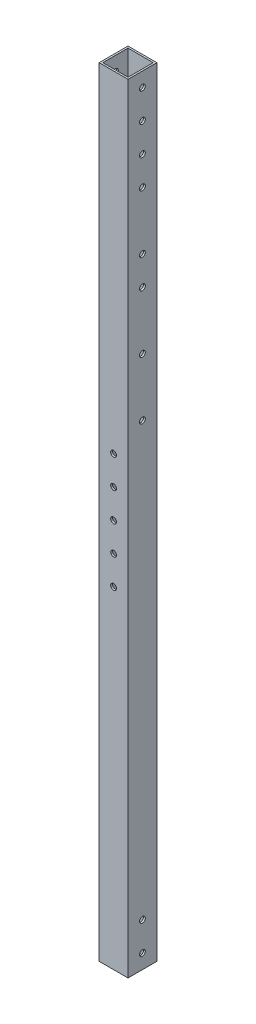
ISO-10303-21;
HEADER;
FILE_DESCRIPTION(('STEP AP214'),'2;1');
FILE_NAME('part.step','',(''),(''),'','','');
FILE_SCHEMA(('AUTOMOTIVE_DESIGN { 1 0 10303 214 1 1 1 1 }'));
ENDSEC;
DATA;
#1=APPLICATION_CONTEXT('core data for automotive mechanical design processes');
#2=APPLICATION_PROTOCOL_DEFINITION('international standard','automotive_design',2000,#1);
#3=PRODUCT_CONTEXT('',#1,'mechanical');
#4=PRODUCT('Part','Part','',(#3));
#5=PRODUCT_RELATED_PRODUCT_CATEGORY('part','',(#4));
#6=PRODUCT_DEFINITION_FORMATION('','',#4);
#7=PRODUCT_DEFINITION_CONTEXT('part definition',#1,'design');
#8=PRODUCT_DEFINITION('design','',#6,#7);
#9=PRODUCT_DEFINITION_SHAPE('','',#8);
#10=(LENGTH_UNIT() NAMED_UNIT(*) SI_UNIT(.MILLI.,.METRE.));
#11=(NAMED_UNIT(*) PLANE_ANGLE_UNIT() SI_UNIT($,.RADIAN.));
#12=(NAMED_UNIT(*) SI_UNIT($,.STERADIAN.) SOLID_ANGLE_UNIT());
#13=UNCERTAINTY_MEASURE_WITH_UNIT(LENGTH_MEASURE(1.E-05),#10,'distance_accuracy_value','');
#14=(GEOMETRIC_REPRESENTATION_CONTEXT(3) GLOBAL_UNCERTAINTY_ASSIGNED_CONTEXT((#13)) GLOBAL_UNIT_ASSIGNED_CONTEXT((#10,
#11,#12)) REPRESENTATION_CONTEXT('',''));
#15=CARTESIAN_POINT('',(0.,0.,0.));
#16=DIRECTION('',(0.,0.,1.));
#17=DIRECTION('',(1.,0.,0.));
#18=AXIS2_PLACEMENT_3D('',#15,#16,#17);
#19=CARTESIAN_POINT('',(0.,685.8,0.));
#20=DIRECTION('',(0.,-1.,0.));
#21=DIRECTION('',(0.,0.,-1.));
#22=AXIS2_PLACEMENT_3D('',#19,#20,#21);
#23=PLANE('',#22);
#24=DIRECTION('',(0.,0.,-1.));
#25=VECTOR('',#24,1.);
#26=CARTESIAN_POINT('',(12.7,685.8,12.7));
#27=LINE('',#26,#25);
#28=CARTESIAN_POINT('',(12.7,685.8,12.7));
#29=VERTEX_POINT('',#28);
#30=CARTESIAN_POINT('',(12.7,685.8,-12.7));
#31=VERTEX_POINT('',#30);
#32=EDGE_CURVE('E137',#29,#31,#27,.T.);
#33=ORIENTED_EDGE('',*,*,#32,.T.);
#34=DIRECTION('',(-1.,0.,0.));
#35=VECTOR('',#34,1.);
#36=CARTESIAN_POINT('',(-12.7,685.8,-12.7));
#37=LINE('',#36,#35);
#38=CARTESIAN_POINT('',(-12.7,685.8,-12.7));
#39=VERTEX_POINT('',#38);
#40=EDGE_CURVE('E140',#31,#39,#37,.T.);
#41=ORIENTED_EDGE('',*,*,#40,.T.);
#42=DIRECTION('',(0.,0.,1.));
#43=VECTOR('',#42,1.);
#44=CARTESIAN_POINT('',(-12.7,685.8,12.7));
#45=LINE('',#44,#43);
#46=CARTESIAN_POINT('',(-12.7,685.8,12.7));
#47=VERTEX_POINT('',#46);
#48=EDGE_CURVE('E143',#39,#47,#45,.T.);
#49=ORIENTED_EDGE('',*,*,#48,.T.);
#50=DIRECTION('',(1.,0.,0.));
#51=VECTOR('',#50,1.);
#52=CARTESIAN_POINT('',(-12.7,685.8,12.7));
#53=LINE('',#52,#51);
#54=EDGE_CURVE('E145',#47,#29,#53,.T.);
#55=ORIENTED_EDGE('',*,*,#54,.T.);
#56=EDGE_LOOP('',(#33,#41,#49,#55));
#57=FACE_BOUND('',#56,.T.);
#58=DIRECTION('',(0.,0.,-1.));
#59=VECTOR('',#58,1.);
#60=CARTESIAN_POINT('',(11.1125,685.8,11.1125));
#61=LINE('',#60,#59);
#62=CARTESIAN_POINT('',(11.1125,685.8,11.1125));
#63=VERTEX_POINT('',#62);
#64=CARTESIAN_POINT('',(11.1125,685.8,-11.1125));
#65=VERTEX_POINT('',#64);
#66=EDGE_CURVE('E99',#63,#65,#61,.T.);
#67=ORIENTED_EDGE('',*,*,#66,.F.);
#68=DIRECTION('',(1.,0.,0.));
#69=VECTOR('',#68,1.);
#70=CARTESIAN_POINT('',(-11.1125,685.8,11.1125));
#71=LINE('',#70,#69);
#72=CARTESIAN_POINT('',(-11.1125,685.8,11.1125));
#73=VERTEX_POINT('',#72);
#74=EDGE_CURVE('E121',#73,#63,#71,.T.);
#75=ORIENTED_EDGE('',*,*,#74,.F.);
#76=DIRECTION('',(0.,0.,1.));
#77=VECTOR('',#76,1.);
#78=CARTESIAN_POINT('',(-11.1125,685.8,11.1125));
#79=LINE('',#78,#77);
#80=CARTESIAN_POINT('',(-11.1125,685.8,-11.1125));
#81=VERTEX_POINT('',#80);
#82=EDGE_CURVE('E119',#81,#73,#79,.T.);
#83=ORIENTED_EDGE('',*,*,#82,.F.);
#84=DIRECTION('',(-1.,0.,0.));
#85=VECTOR('',#84,1.);
#86=CARTESIAN_POINT('',(-11.1125,685.8,-11.1125));
#87=LINE('',#86,#85);
#88=EDGE_CURVE('E107',#65,#81,#87,.T.);
#89=ORIENTED_EDGE('',*,*,#88,.F.);
#90=EDGE_LOOP('',(#67,#75,#83,#89));
#91=FACE_BOUND('',#90,.T.);
#92=ADVANCED_FACE('F32',(#57,#91),#23,.F.);
#93=CARTESIAN_POINT('',(0.,0.,0.));
#94=DIRECTION('',(0.,-1.,0.));
#95=DIRECTION('',(0.,0.,-1.));
#96=AXIS2_PLACEMENT_3D('',#93,#94,#95);
#97=PLANE('',#96);
#98=DIRECTION('',(0.,0.,-1.));
#99=VECTOR('',#98,1.);
#100=CARTESIAN_POINT('',(12.7,0.,12.7));
#101=LINE('',#100,#99);
#102=CARTESIAN_POINT('',(12.7,0.,12.7));
#103=VERTEX_POINT('',#102);
#104=CARTESIAN_POINT('',(12.7,0.,-12.7));
#105=VERTEX_POINT('',#104);
#106=EDGE_CURVE('E115',#103,#105,#101,.T.);
#107=ORIENTED_EDGE('',*,*,#106,.F.);
#108=DIRECTION('',(1.,0.,0.));
#109=VECTOR('',#108,1.);
#110=CARTESIAN_POINT('',(-12.7,0.,12.7));
#111=LINE('',#110,#109);
#112=CARTESIAN_POINT('',(-12.7,0.,12.7));
#113=VERTEX_POINT('',#112);
#114=EDGE_CURVE('E141',#113,#103,#111,.T.);
#115=ORIENTED_EDGE('',*,*,#114,.F.);
#116=DIRECTION('',(0.,0.,1.));
#117=VECTOR('',#116,1.);
#118=CARTESIAN_POINT('',(-12.7,0.,12.7));
#119=LINE('',#118,#117);
#120=CARTESIAN_POINT('',(-12.7,0.,-12.7));
#121=VERTEX_POINT('',#120);
#122=EDGE_CURVE('E152',#121,#113,#119,.T.);
#123=ORIENTED_EDGE('',*,*,#122,.F.);
#124=DIRECTION('',(-1.,0.,0.));
#125=VECTOR('',#124,1.);
#126=CARTESIAN_POINT('',(-12.7,0.,-12.7));
#127=LINE('',#126,#125);
#128=EDGE_CURVE('E150',#105,#121,#127,.T.);
#129=ORIENTED_EDGE('',*,*,#128,.F.);
#130=EDGE_LOOP('',(#107,#115,#123,#129));
#131=FACE_BOUND('',#130,.T.);
#132=DIRECTION('',(1.,0.,0.));
#133=VECTOR('',#132,1.);
#134=CARTESIAN_POINT('',(-11.1125,0.,11.1125));
#135=LINE('',#134,#133);
#136=CARTESIAN_POINT('',(-11.1125,0.,11.1125));
#137=VERTEX_POINT('',#136);
#138=CARTESIAN_POINT('',(11.1125,0.,11.1125));
#139=VERTEX_POINT('',#138);
#140=EDGE_CURVE('E108',#137,#139,#135,.T.);
#141=ORIENTED_EDGE('',*,*,#140,.T.);
#142=DIRECTION('',(0.,0.,-1.));
#143=VECTOR('',#142,1.);
#144=CARTESIAN_POINT('',(11.1125,0.,11.1125));
#145=LINE('',#144,#143);
#146=CARTESIAN_POINT('',(11.1125,0.,-11.1125));
#147=VERTEX_POINT('',#146);
#148=EDGE_CURVE('E57',#139,#147,#145,.T.);
#149=ORIENTED_EDGE('',*,*,#148,.T.);
#150=DIRECTION('',(-1.,0.,0.));
#151=VECTOR('',#150,1.);
#152=CARTESIAN_POINT('',(-11.1125,0.,-11.1125));
#153=LINE('',#152,#151);
#154=CARTESIAN_POINT('',(-11.1125,0.,-11.1125));
#155=VERTEX_POINT('',#154);
#156=EDGE_CURVE('E114',#147,#155,#153,.T.);
#157=ORIENTED_EDGE('',*,*,#156,.T.);
#158=DIRECTION('',(0.,0.,1.));
#159=VECTOR('',#158,1.);
#160=CARTESIAN_POINT('',(-11.1125,0.,11.1125));
#161=LINE('',#160,#159);
#162=EDGE_CURVE('E129',#155,#137,#161,.T.);
#163=ORIENTED_EDGE('',*,*,#162,.T.);
#164=EDGE_LOOP('',(#141,#149,#157,#163));
#165=FACE_BOUND('',#164,.T.);
#166=ADVANCED_FACE('F354',(#131,#165),#97,.T.);
#167=CARTESIAN_POINT('',(12.7,685.8,12.7));
#168=DIRECTION('',(-1.,0.,0.));
#169=DIRECTION('',(0.,0.,1.));
#170=AXIS2_PLACEMENT_3D('',#167,#168,#169);
#171=PLANE('',#170);
#172=CARTESIAN_POINT('',(12.7,12.7,0.));
#173=DIRECTION('',(1.,0.,0.));
#174=DIRECTION('',(0.,0.,-1.));
#175=AXIS2_PLACEMENT_3D('',#172,#173,#174);
#176=CIRCLE('',#175,2.55269999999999);
#177=CARTESIAN_POINT('',(12.7,12.7,-2.55269999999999));
#178=VERTEX_POINT('',#177);
#179=EDGE_CURVE('E493',#178,#178,#176,.T.);
#180=ORIENTED_EDGE('',*,*,#179,.F.);
#181=EDGE_LOOP('',(#180));
#182=FACE_BOUND('',#181,.T.);
#183=CARTESIAN_POINT('',(12.7,38.1,0.));
#184=DIRECTION('',(1.,0.,0.));
#185=DIRECTION('',(0.,0.,-1.));
#186=AXIS2_PLACEMENT_3D('',#183,#184,#185);
#187=CIRCLE('',#186,2.55269999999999);
#188=CARTESIAN_POINT('',(12.7,38.1,-2.5526999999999));
#189=VERTEX_POINT('',#188);
#190=EDGE_CURVE('E201',#189,#189,#187,.T.);
#191=ORIENTED_EDGE('',*,*,#190,.F.);
#192=EDGE_LOOP('',(#191));
#193=FACE_BOUND('',#192,.T.);
#194=CARTESIAN_POINT('',(12.7,622.3,2.09107978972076E-12));
#195=DIRECTION('',(1.,0.,0.));
#196=DIRECTION('',(0.,0.,-1.));
#197=AXIS2_PLACEMENT_3D('',#194,#195,#196);
#198=CIRCLE('',#197,2.55269999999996);
#199=CARTESIAN_POINT('',(12.7,622.3,-2.55269999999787));
#200=VERTEX_POINT('',#199);
#201=EDGE_CURVE('E198',#200,#200,#198,.T.);
#202=ORIENTED_EDGE('',*,*,#201,.F.);
#203=EDGE_LOOP('',(#202));
#204=FACE_BOUND('',#203,.T.);
#205=CARTESIAN_POINT('',(12.7,647.7,2.17820811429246E-12));
#206=DIRECTION('',(1.,0.,0.));
#207=DIRECTION('',(0.,0.,-1.));
#208=AXIS2_PLACEMENT_3D('',#205,#206,#207);
#209=CIRCLE('',#208,2.55269999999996);
#210=CARTESIAN_POINT('',(12.7,647.7,-2.55269999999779));
#211=VERTEX_POINT('',#210);
#212=EDGE_CURVE('E221',#211,#211,#209,.T.);
#213=ORIENTED_EDGE('',*,*,#212,.F.);
#214=EDGE_LOOP('',(#213));
#215=FACE_BOUND('',#214,.T.);
#216=CARTESIAN_POINT('',(12.7,673.1,2.26533643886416E-12));
#217=DIRECTION('',(1.,0.,0.));
#218=DIRECTION('',(0.,0.,-1.));
#219=AXIS2_PLACEMENT_3D('',#216,#217,#218);
#220=CIRCLE('',#219,2.55269999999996);
#221=CARTESIAN_POINT('',(12.7,673.1,-2.5526999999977));
#222=VERTEX_POINT('',#221);
#223=EDGE_CURVE('E228',#222,#222,#220,.T.);
#224=ORIENTED_EDGE('',*,*,#223,.F.);
#225=EDGE_LOOP('',(#224));
#226=FACE_BOUND('',#225,.T.);
#227=CARTESIAN_POINT('',(12.7,596.9,2.09107978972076E-12));
#228=DIRECTION('',(1.,0.,0.));
#229=DIRECTION('',(0.,0.,-1.));
#230=AXIS2_PLACEMENT_3D('',#227,#228,#229);
#231=CIRCLE('',#230,2.55269999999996);
#232=CARTESIAN_POINT('',(12.7,596.9,-2.55269999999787));
#233=VERTEX_POINT('',#232);
#234=EDGE_CURVE('E235',#233,#233,#231,.T.);
#235=ORIENTED_EDGE('',*,*,#234,.F.);
#236=EDGE_LOOP('',(#235));
#237=FACE_BOUND('',#236,.T.);
#238=CARTESIAN_POINT('',(12.7,520.7,0.));
#239=DIRECTION('',(1.,0.,0.));
#240=DIRECTION('',(0.,0.,-1.));
#241=AXIS2_PLACEMENT_3D('',#238,#239,#240);
#242=CIRCLE('',#241,2.55269999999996);
#243=CARTESIAN_POINT('',(12.7,520.7,-2.55269999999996));
#244=VERTEX_POINT('',#243);
#245=EDGE_CURVE('E242',#244,#244,#242,.T.);
#246=ORIENTED_EDGE('',*,*,#245,.F.);
#247=EDGE_LOOP('',(#246));
#248=FACE_BOUND('',#247,.T.);
#249=CARTESIAN_POINT('',(12.7,546.1,0.));
#250=DIRECTION('',(1.,0.,0.));
#251=DIRECTION('',(0.,0.,-1.));
#252=AXIS2_PLACEMENT_3D('',#249,#250,#251);
#253=CIRCLE('',#252,2.55269999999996);
#254=CARTESIAN_POINT('',(12.7,546.1,-2.55269999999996));
#255=VERTEX_POINT('',#254);
#256=EDGE_CURVE('E254',#255,#255,#253,.T.);
#257=ORIENTED_EDGE('',*,*,#256,.F.);
#258=EDGE_LOOP('',(#257));
#259=FACE_BOUND('',#258,.T.);
#260=CARTESIAN_POINT('',(12.7,469.9,0.));
#261=DIRECTION('',(1.,0.,0.));
#262=DIRECTION('',(0.,0.,-1.));
#263=AXIS2_PLACEMENT_3D('',#260,#261,#262);
#264=CIRCLE('',#263,2.55269999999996);
#265=CARTESIAN_POINT('',(12.7,469.9,-2.55269999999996));
#266=VERTEX_POINT('',#265);
#267=EDGE_CURVE('E261',#266,#266,#264,.T.);
#268=ORIENTED_EDGE('',*,*,#267,.F.);
#269=EDGE_LOOP('',(#268));
#270=FACE_BOUND('',#269,.T.);
#271=CARTESIAN_POINT('',(12.7,419.1,0.));
#272=DIRECTION('',(1.,0.,0.));
#273=DIRECTION('',(0.,0.,-1.));
#274=AXIS2_PLACEMENT_3D('',#271,#272,#273);
#275=CIRCLE('',#274,2.55269999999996);
#276=CARTESIAN_POINT('',(12.7,419.1,-2.55269999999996));
#277=VERTEX_POINT('',#276);
#278=EDGE_CURVE('E268',#277,#277,#275,.T.);
#279=ORIENTED_EDGE('',*,*,#278,.F.);
#280=EDGE_LOOP('',(#279));
#281=FACE_BOUND('',#280,.T.);
#282=ORIENTED_EDGE('',*,*,#106,.T.);
#283=DIRECTION('',(0.,-1.,0.));
#284=VECTOR('',#283,1.);
#285=CARTESIAN_POINT('',(12.7,685.8,-12.7));
#286=LINE('',#285,#284);
#287=EDGE_CURVE('E11',#31,#105,#286,.T.);
#288=ORIENTED_EDGE('',*,*,#287,.F.);
#289=ORIENTED_EDGE('',*,*,#32,.F.);
#290=DIRECTION('',(0.,-1.,0.));
#291=VECTOR('',#290,1.);
#292=CARTESIAN_POINT('',(12.7,685.8,12.7));
#293=LINE('',#292,#291);
#294=EDGE_CURVE('E147',#29,#103,#293,.T.);
#295=ORIENTED_EDGE('',*,*,#294,.T.);
#296=EDGE_LOOP('',(#282,#288,#289,#295));
#297=FACE_BOUND('',#296,.T.);
#298=ADVANCED_FACE('F34',(#182,#193,#204,#215,#226,#237,#248,#259,#270,#281,#297),#171,.F.);
#299=CARTESIAN_POINT('',(-12.7,685.8,-12.7));
#300=DIRECTION('',(0.,0.,1.));
#301=DIRECTION('',(1.,0.,0.));
#302=AXIS2_PLACEMENT_3D('',#299,#300,#301);
#303=PLANE('',#302);
#304=CARTESIAN_POINT('',(-9.58411570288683E-13,292.1,-12.7));
#305=DIRECTION('',(0.,0.,1.));
#306=DIRECTION('',(1.,0.,0.));
#307=AXIS2_PLACEMENT_3D('',#304,#305,#306);
#308=CIRCLE('',#307,2.55269999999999);
#309=CARTESIAN_POINT('',(2.55269999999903,292.1,-12.7));
#310=VERTEX_POINT('',#309);
#311=EDGE_CURVE('E283',#310,#310,#308,.T.);
#312=ORIENTED_EDGE('',*,*,#311,.T.);
#313=EDGE_LOOP('',(#312));
#314=FACE_BOUND('',#313,.T.);
#315=CARTESIAN_POINT('',(-1.04553989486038E-12,317.5,-12.7));
#316=DIRECTION('',(0.,0.,1.));
#317=DIRECTION('',(1.,0.,0.));
#318=AXIS2_PLACEMENT_3D('',#315,#316,#317);
#319=CIRCLE('',#318,2.55269999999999);
#320=CARTESIAN_POINT('',(2.55269999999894,317.5,-12.7));
#321=VERTEX_POINT('',#320);
#322=EDGE_CURVE('E295',#321,#321,#319,.T.);
#323=ORIENTED_EDGE('',*,*,#322,.T.);
#324=EDGE_LOOP('',(#323));
#325=FACE_BOUND('',#324,.T.);
#326=CARTESIAN_POINT('',(-1.13266821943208E-12,342.9,-12.7));
#327=DIRECTION('',(0.,0.,1.));
#328=DIRECTION('',(1.,0.,0.));
#329=AXIS2_PLACEMENT_3D('',#326,#327,#328);
#330=CIRCLE('',#329,2.55269999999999);
#331=CARTESIAN_POINT('',(2.55269999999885,342.9,-12.7));
#332=VERTEX_POINT('',#331);
#333=EDGE_CURVE('E166',#332,#332,#330,.T.);
#334=ORIENTED_EDGE('',*,*,#333,.T.);
#335=EDGE_LOOP('',(#334));
#336=FACE_BOUND('',#335,.T.);
#337=CARTESIAN_POINT('',(-1.21979654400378E-12,368.3,-12.7));
#338=DIRECTION('',(0.,0.,1.));
#339=DIRECTION('',(1.,0.,0.));
#340=AXIS2_PLACEMENT_3D('',#337,#338,#339);
#341=CIRCLE('',#340,2.55269999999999);
#342=CARTESIAN_POINT('',(2.55269999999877,368.3,-12.7));
#343=VERTEX_POINT('',#342);
#344=EDGE_CURVE('E314',#343,#343,#341,.T.);
#345=ORIENTED_EDGE('',*,*,#344,.T.);
#346=EDGE_LOOP('',(#345));
#347=FACE_BOUND('',#346,.T.);
#348=CARTESIAN_POINT('',(-1.30692486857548E-12,393.7,-12.7));
#349=DIRECTION('',(0.,0.,1.));
#350=DIRECTION('',(1.,0.,0.));
#351=AXIS2_PLACEMENT_3D('',#348,#349,#350);
#352=CIRCLE('',#351,2.55269999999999);
#353=CARTESIAN_POINT('',(2.55269999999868,393.7,-12.7));
#354=VERTEX_POINT('',#353);
#355=EDGE_CURVE('E326',#354,#354,#352,.T.);
#356=ORIENTED_EDGE('',*,*,#355,.T.);
#357=EDGE_LOOP('',(#356));
#358=FACE_BOUND('',#357,.T.);
#359=ORIENTED_EDGE('',*,*,#128,.T.);
#360=DIRECTION('',(0.,-1.,0.));
#361=VECTOR('',#360,1.);
#362=CARTESIAN_POINT('',(-12.7,685.8,-12.7));
#363=LINE('',#362,#361);
#364=EDGE_CURVE('E41',#39,#121,#363,.T.);
#365=ORIENTED_EDGE('',*,*,#364,.F.);
#366=ORIENTED_EDGE('',*,*,#40,.F.);
#367=ORIENTED_EDGE('',*,*,#287,.T.);
#368=EDGE_LOOP('',(#359,#365,#366,#367));
#369=FACE_BOUND('',#368,.T.);
#370=ADVANCED_FACE('F368',(#314,#325,#336,#347,#358,#369),#303,.F.);
#371=CARTESIAN_POINT('',(-12.7,685.8,12.7));
#372=DIRECTION('',(1.,0.,0.));
#373=DIRECTION('',(0.,0.,-1.));
#374=AXIS2_PLACEMENT_3D('',#371,#372,#373);
#375=PLANE('',#374);
#376=CARTESIAN_POINT('',(-12.7,12.7,0.));
#377=DIRECTION('',(1.,0.,0.));
#378=DIRECTION('',(0.,0.,-1.));
#379=AXIS2_PLACEMENT_3D('',#376,#377,#378);
#380=CIRCLE('',#379,2.55269999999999);
#381=CARTESIAN_POINT('',(-12.7,12.7,-2.55269999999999));
#382=VERTEX_POINT('',#381);
#383=EDGE_CURVE('E492',#382,#382,#380,.T.);
#384=ORIENTED_EDGE('',*,*,#383,.T.);
#385=EDGE_LOOP('',(#384));
#386=FACE_BOUND('',#385,.T.);
#387=CARTESIAN_POINT('',(-12.7,38.1,0.));
#388=DIRECTION('',(1.,0.,0.));
#389=DIRECTION('',(0.,0.,-1.));
#390=AXIS2_PLACEMENT_3D('',#387,#388,#389);
#391=CIRCLE('',#390,2.55269999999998);
#392=CARTESIAN_POINT('',(-12.7,38.1,-2.5526999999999));
#393=VERTEX_POINT('',#392);
#394=EDGE_CURVE('E194',#393,#393,#391,.T.);
#395=ORIENTED_EDGE('',*,*,#394,.T.);
#396=EDGE_LOOP('',(#395));
#397=FACE_BOUND('',#396,.T.);
#398=CARTESIAN_POINT('',(-12.7,622.3,2.09107978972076E-12));
#399=DIRECTION('',(1.,0.,0.));
#400=DIRECTION('',(0.,0.,-1.));
#401=AXIS2_PLACEMENT_3D('',#398,#399,#400);
#402=CIRCLE('',#401,2.55269999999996);
#403=CARTESIAN_POINT('',(-12.7,622.3,-2.55269999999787));
#404=VERTEX_POINT('',#403);
#405=EDGE_CURVE('E212',#404,#404,#402,.T.);
#406=ORIENTED_EDGE('',*,*,#405,.T.);
#407=EDGE_LOOP('',(#406));
#408=FACE_BOUND('',#407,.T.);
#409=CARTESIAN_POINT('',(-12.7,647.7,2.17820811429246E-12));
#410=DIRECTION('',(1.,0.,0.));
#411=DIRECTION('',(0.,0.,-1.));
#412=AXIS2_PLACEMENT_3D('',#409,#410,#411);
#413=CIRCLE('',#412,2.55269999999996);
#414=CARTESIAN_POINT('',(-12.7,647.7,-2.55269999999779));
#415=VERTEX_POINT('',#414);
#416=EDGE_CURVE('E190',#415,#415,#413,.T.);
#417=ORIENTED_EDGE('',*,*,#416,.T.);
#418=EDGE_LOOP('',(#417));
#419=FACE_BOUND('',#418,.T.);
#420=CARTESIAN_POINT('',(-12.7,673.1,2.26533643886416E-12));
#421=DIRECTION('',(1.,0.,0.));
#422=DIRECTION('',(0.,0.,-1.));
#423=AXIS2_PLACEMENT_3D('',#420,#421,#422);
#424=CIRCLE('',#423,2.55269999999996);
#425=CARTESIAN_POINT('',(-12.7,673.1,-2.5526999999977));
#426=VERTEX_POINT('',#425);
#427=EDGE_CURVE('E186',#426,#426,#424,.T.);
#428=ORIENTED_EDGE('',*,*,#427,.T.);
#429=EDGE_LOOP('',(#428));
#430=FACE_BOUND('',#429,.T.);
#431=CARTESIAN_POINT('',(-12.7,596.9,2.09107978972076E-12));
#432=DIRECTION('',(1.,0.,0.));
#433=DIRECTION('',(0.,0.,-1.));
#434=AXIS2_PLACEMENT_3D('',#431,#432,#433);
#435=CIRCLE('',#434,2.55269999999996);
#436=CARTESIAN_POINT('',(-12.7,596.9,-2.55269999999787));
#437=VERTEX_POINT('',#436);
#438=EDGE_CURVE('E181',#437,#437,#435,.T.);
#439=ORIENTED_EDGE('',*,*,#438,.T.);
#440=EDGE_LOOP('',(#439));
#441=FACE_BOUND('',#440,.T.);
#442=CARTESIAN_POINT('',(-12.7,520.7,0.));
#443=DIRECTION('',(1.,0.,0.));
#444=DIRECTION('',(0.,0.,-1.));
#445=AXIS2_PLACEMENT_3D('',#442,#443,#444);
#446=CIRCLE('',#445,2.55269999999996);
#447=CARTESIAN_POINT('',(-12.7,520.7,-2.55269999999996));
#448=VERTEX_POINT('',#447);
#449=EDGE_CURVE('E245',#448,#448,#446,.T.);
#450=ORIENTED_EDGE('',*,*,#449,.T.);
#451=EDGE_LOOP('',(#450));
#452=FACE_BOUND('',#451,.T.);
#453=CARTESIAN_POINT('',(-12.7,546.1,0.));
#454=DIRECTION('',(1.,0.,0.));
#455=DIRECTION('',(0.,0.,-1.));
#456=AXIS2_PLACEMENT_3D('',#453,#454,#455);
#457=CIRCLE('',#456,2.55269999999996);
#458=CARTESIAN_POINT('',(-12.7,546.1,-2.55269999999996));
#459=VERTEX_POINT('',#458);
#460=EDGE_CURVE('E176',#459,#459,#457,.T.);
#461=ORIENTED_EDGE('',*,*,#460,.T.);
#462=EDGE_LOOP('',(#461));
#463=FACE_BOUND('',#462,.T.);
#464=CARTESIAN_POINT('',(-12.7,469.9,0.));
#465=DIRECTION('',(1.,0.,0.));
#466=DIRECTION('',(0.,0.,-1.));
#467=AXIS2_PLACEMENT_3D('',#464,#465,#466);
#468=CIRCLE('',#467,2.55269999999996);
#469=CARTESIAN_POINT('',(-12.7,469.9,-2.55269999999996));
#470=VERTEX_POINT('',#469);
#471=EDGE_CURVE('E171',#470,#470,#468,.T.);
#472=ORIENTED_EDGE('',*,*,#471,.T.);
#473=EDGE_LOOP('',(#472));
#474=FACE_BOUND('',#473,.T.);
#475=CARTESIAN_POINT('',(-12.7,419.1,0.));
#476=DIRECTION('',(1.,0.,0.));
#477=DIRECTION('',(0.,0.,-1.));
#478=AXIS2_PLACEMENT_3D('',#475,#476,#477);
#479=CIRCLE('',#478,2.55269999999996);
#480=CARTESIAN_POINT('',(-12.7,419.1,-2.55269999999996));
#481=VERTEX_POINT('',#480);
#482=EDGE_CURVE('E271',#481,#481,#479,.T.);
#483=ORIENTED_EDGE('',*,*,#482,.T.);
#484=EDGE_LOOP('',(#483));
#485=FACE_BOUND('',#484,.T.);
#486=ORIENTED_EDGE('',*,*,#122,.T.);
#487=DIRECTION('',(0.,-1.,0.));
#488=VECTOR('',#487,1.);
#489=CARTESIAN_POINT('',(-12.7,685.8,12.7));
#490=LINE('',#489,#488);
#491=EDGE_CURVE('E157',#47,#113,#490,.T.);
#492=ORIENTED_EDGE('',*,*,#491,.F.);
#493=ORIENTED_EDGE('',*,*,#48,.F.);
#494=ORIENTED_EDGE('',*,*,#364,.T.);
#495=EDGE_LOOP('',(#486,#492,#493,#494));
#496=FACE_BOUND('',#495,.T.);
#497=ADVANCED_FACE('F365',(#386,#397,#408,#419,#430,#441,#452,#463,#474,#485,#496),#375,.F.);
#498=CARTESIAN_POINT('',(-12.7,685.8,12.7));
#499=DIRECTION('',(0.,0.,-1.));
#500=DIRECTION('',(-1.,0.,0.));
#501=AXIS2_PLACEMENT_3D('',#498,#499,#500);
#502=PLANE('',#501);
#503=CARTESIAN_POINT('',(-9.58411570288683E-13,292.1,12.7));
#504=DIRECTION('',(0.,0.,1.));
#505=DIRECTION('',(1.,0.,0.));
#506=AXIS2_PLACEMENT_3D('',#503,#504,#505);
#507=CIRCLE('',#506,2.55269999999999);
#508=CARTESIAN_POINT('',(2.55269999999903,292.1,12.7));
#509=VERTEX_POINT('',#508);
#510=EDGE_CURVE('E280',#509,#509,#507,.T.);
#511=ORIENTED_EDGE('',*,*,#510,.F.);
#512=EDGE_LOOP('',(#511));
#513=FACE_BOUND('',#512,.T.);
#514=CARTESIAN_POINT('',(-1.04553989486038E-12,317.5,12.7));
#515=DIRECTION('',(0.,0.,1.));
#516=DIRECTION('',(1.,0.,0.));
#517=AXIS2_PLACEMENT_3D('',#514,#515,#516);
#518=CIRCLE('',#517,2.55269999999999);
#519=CARTESIAN_POINT('',(2.55269999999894,317.5,12.7));
#520=VERTEX_POINT('',#519);
#521=EDGE_CURVE('E292',#520,#520,#518,.T.);
#522=ORIENTED_EDGE('',*,*,#521,.F.);
#523=EDGE_LOOP('',(#522));
#524=FACE_BOUND('',#523,.T.);
#525=CARTESIAN_POINT('',(-1.13266821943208E-12,342.9,12.7));
#526=DIRECTION('',(0.,0.,1.));
#527=DIRECTION('',(1.,0.,0.));
#528=AXIS2_PLACEMENT_3D('',#525,#526,#527);
#529=CIRCLE('',#528,2.55269999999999);
#530=CARTESIAN_POINT('',(2.55269999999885,342.9,12.7));
#531=VERTEX_POINT('',#530);
#532=EDGE_CURVE('E304',#531,#531,#529,.T.);
#533=ORIENTED_EDGE('',*,*,#532,.F.);
#534=EDGE_LOOP('',(#533));
#535=FACE_BOUND('',#534,.T.);
#536=CARTESIAN_POINT('',(-1.21979654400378E-12,368.3,12.7));
#537=DIRECTION('',(0.,0.,1.));
#538=DIRECTION('',(1.,0.,0.));
#539=AXIS2_PLACEMENT_3D('',#536,#537,#538);
#540=CIRCLE('',#539,2.55269999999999);
#541=CARTESIAN_POINT('',(2.55269999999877,368.3,12.7));
#542=VERTEX_POINT('',#541);
#543=EDGE_CURVE('E311',#542,#542,#540,.T.);
#544=ORIENTED_EDGE('',*,*,#543,.F.);
#545=EDGE_LOOP('',(#544));
#546=FACE_BOUND('',#545,.T.);
#547=CARTESIAN_POINT('',(-1.30692486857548E-12,393.7,12.7));
#548=DIRECTION('',(0.,0.,1.));
#549=DIRECTION('',(1.,0.,0.));
#550=AXIS2_PLACEMENT_3D('',#547,#548,#549);
#551=CIRCLE('',#550,2.55269999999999);
#552=CARTESIAN_POINT('',(2.55269999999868,393.7,12.7));
#553=VERTEX_POINT('',#552);
#554=EDGE_CURVE('E323',#553,#553,#551,.T.);
#555=ORIENTED_EDGE('',*,*,#554,.F.);
#556=EDGE_LOOP('',(#555));
#557=FACE_BOUND('',#556,.T.);
#558=ORIENTED_EDGE('',*,*,#114,.T.);
#559=ORIENTED_EDGE('',*,*,#294,.F.);
#560=ORIENTED_EDGE('',*,*,#54,.F.);
#561=ORIENTED_EDGE('',*,*,#491,.T.);
#562=EDGE_LOOP('',(#558,#559,#560,#561));
#563=FACE_BOUND('',#562,.T.);
#564=ADVANCED_FACE('F348',(#513,#524,#535,#546,#557,#563),#502,.F.);
#565=CARTESIAN_POINT('',(11.1125,685.8,11.1125));
#566=DIRECTION('',(-1.,0.,0.));
#567=DIRECTION('',(0.,0.,1.));
#568=AXIS2_PLACEMENT_3D('',#565,#566,#567);
#569=PLANE('',#568);
#570=CARTESIAN_POINT('',(11.1125,12.7,0.));
#571=DIRECTION('',(-1.,0.,0.));
#572=DIRECTION('',(0.,0.,1.));
#573=AXIS2_PLACEMENT_3D('',#570,#571,#572);
#574=CIRCLE('',#573,2.55269999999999);
#575=CARTESIAN_POINT('',(11.1125,12.7,2.55269999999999));
#576=VERTEX_POINT('',#575);
#577=EDGE_CURVE('E206',#576,#576,#574,.T.);
#578=ORIENTED_EDGE('',*,*,#577,.F.);
#579=EDGE_LOOP('',(#578));
#580=FACE_BOUND('',#579,.T.);
#581=CARTESIAN_POINT('',(11.1125,38.1,0.));
#582=DIRECTION('',(-1.,0.,0.));
#583=DIRECTION('',(0.,0.,1.));
#584=AXIS2_PLACEMENT_3D('',#581,#582,#583);
#585=CIRCLE('',#584,2.55269999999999);
#586=CARTESIAN_POINT('',(11.1125,38.1,2.55270000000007));
#587=VERTEX_POINT('',#586);
#588=EDGE_CURVE('E193',#587,#587,#585,.T.);
#589=ORIENTED_EDGE('',*,*,#588,.F.);
#590=EDGE_LOOP('',(#589));
#591=FACE_BOUND('',#590,.T.);
#592=CARTESIAN_POINT('',(11.1125,622.3,2.09107978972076E-12));
#593=DIRECTION('',(-1.,0.,0.));
#594=DIRECTION('',(0.,0.,1.));
#595=AXIS2_PLACEMENT_3D('',#592,#593,#594);
#596=CIRCLE('',#595,2.55269999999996);
#597=CARTESIAN_POINT('',(11.1125,622.3,2.55270000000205));
#598=VERTEX_POINT('',#597);
#599=EDGE_CURVE('E218',#598,#598,#596,.T.);
#600=ORIENTED_EDGE('',*,*,#599,.F.);
#601=EDGE_LOOP('',(#600));
#602=FACE_BOUND('',#601,.T.);
#603=CARTESIAN_POINT('',(11.1125,647.7,2.17820811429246E-12));
#604=DIRECTION('',(-1.,0.,0.));
#605=DIRECTION('',(0.,0.,1.));
#606=AXIS2_PLACEMENT_3D('',#603,#604,#605);
#607=CIRCLE('',#606,2.55269999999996);
#608=CARTESIAN_POINT('',(11.1125,647.7,2.55270000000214));
#609=VERTEX_POINT('',#608);
#610=EDGE_CURVE('E189',#609,#609,#607,.T.);
#611=ORIENTED_EDGE('',*,*,#610,.F.);
#612=EDGE_LOOP('',(#611));
#613=FACE_BOUND('',#612,.T.);
#614=CARTESIAN_POINT('',(11.1125,673.1,2.26533643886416E-12));
#615=DIRECTION('',(-1.,0.,0.));
#616=DIRECTION('',(0.,0.,1.));
#617=AXIS2_PLACEMENT_3D('',#614,#615,#616);
#618=CIRCLE('',#617,2.55269999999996);
#619=CARTESIAN_POINT('',(11.1125,673.1,2.55270000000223));
#620=VERTEX_POINT('',#619);
#621=EDGE_CURVE('E185',#620,#620,#618,.T.);
#622=ORIENTED_EDGE('',*,*,#621,.F.);
#623=EDGE_LOOP('',(#622));
#624=FACE_BOUND('',#623,.T.);
#625=CARTESIAN_POINT('',(11.1125,596.9,2.09107978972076E-12));
#626=DIRECTION('',(-1.,0.,0.));
#627=DIRECTION('',(0.,0.,1.));
#628=AXIS2_PLACEMENT_3D('',#625,#626,#627);
#629=CIRCLE('',#628,2.55269999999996);
#630=CARTESIAN_POINT('',(11.1125,596.9,2.55270000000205));
#631=VERTEX_POINT('',#630);
#632=EDGE_CURVE('E180',#631,#631,#629,.T.);
#633=ORIENTED_EDGE('',*,*,#632,.F.);
#634=EDGE_LOOP('',(#633));
#635=FACE_BOUND('',#634,.T.);
#636=CARTESIAN_POINT('',(11.1125,520.7,0.));
#637=DIRECTION('',(-1.,0.,0.));
#638=DIRECTION('',(0.,0.,1.));
#639=AXIS2_PLACEMENT_3D('',#636,#637,#638);
#640=CIRCLE('',#639,2.55269999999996);
#641=CARTESIAN_POINT('',(11.1125,520.7,2.55269999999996));
#642=VERTEX_POINT('',#641);
#643=EDGE_CURVE('E251',#642,#642,#640,.T.);
#644=ORIENTED_EDGE('',*,*,#643,.F.);
#645=EDGE_LOOP('',(#644));
#646=FACE_BOUND('',#645,.T.);
#647=CARTESIAN_POINT('',(11.1125,546.1,0.));
#648=DIRECTION('',(-1.,0.,0.));
#649=DIRECTION('',(0.,0.,1.));
#650=AXIS2_PLACEMENT_3D('',#647,#648,#649);
#651=CIRCLE('',#650,2.55269999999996);
#652=CARTESIAN_POINT('',(11.1125,546.1,2.55269999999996));
#653=VERTEX_POINT('',#652);
#654=EDGE_CURVE('E172',#653,#653,#651,.T.);
#655=ORIENTED_EDGE('',*,*,#654,.F.);
#656=EDGE_LOOP('',(#655));
#657=FACE_BOUND('',#656,.T.);
#658=CARTESIAN_POINT('',(11.1125,469.9,0.));
#659=DIRECTION('',(-1.,0.,0.));
#660=DIRECTION('',(0.,0.,1.));
#661=AXIS2_PLACEMENT_3D('',#658,#659,#660);
#662=CIRCLE('',#661,2.55269999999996);
#663=CARTESIAN_POINT('',(11.1125,469.9,2.55269999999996));
#664=VERTEX_POINT('',#663);
#665=EDGE_CURVE('E167',#664,#664,#662,.T.);
#666=ORIENTED_EDGE('',*,*,#665,.F.);
#667=EDGE_LOOP('',(#666));
#668=FACE_BOUND('',#667,.T.);
#669=CARTESIAN_POINT('',(11.1125,419.1,0.));
#670=DIRECTION('',(-1.,0.,0.));
#671=DIRECTION('',(0.,0.,1.));
#672=AXIS2_PLACEMENT_3D('',#669,#670,#671);
#673=CIRCLE('',#672,2.55269999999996);
#674=CARTESIAN_POINT('',(11.1125,419.1,2.55269999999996));
#675=VERTEX_POINT('',#674);
#676=EDGE_CURVE('E277',#675,#675,#673,.T.);
#677=ORIENTED_EDGE('',*,*,#676,.F.);
#678=EDGE_LOOP('',(#677));
#679=FACE_BOUND('',#678,.T.);
#680=ORIENTED_EDGE('',*,*,#148,.F.);
#681=DIRECTION('',(0.,-1.,0.));
#682=VECTOR('',#681,1.);
#683=CARTESIAN_POINT('',(11.1125,685.8,11.1125));
#684=LINE('',#683,#682);
#685=EDGE_CURVE('E103',#63,#139,#684,.T.);
#686=ORIENTED_EDGE('',*,*,#685,.F.);
#687=ORIENTED_EDGE('',*,*,#66,.T.);
#688=DIRECTION('',(0.,-1.,0.));
#689=VECTOR('',#688,1.);
#690=CARTESIAN_POINT('',(11.1125,685.8,-11.1125));
#691=LINE('',#690,#689);
#692=EDGE_CURVE('E102',#65,#147,#691,.T.);
#693=ORIENTED_EDGE('',*,*,#692,.T.);
#694=EDGE_LOOP('',(#680,#686,#687,#693));
#695=FACE_BOUND('',#694,.T.);
#696=ADVANCED_FACE('F101',(#580,#591,#602,#613,#624,#635,#646,#657,#668,#679,#695),#569,.T.);
#697=CARTESIAN_POINT('',(-11.1125,685.8,-11.1125));
#698=DIRECTION('',(0.,0.,1.));
#699=DIRECTION('',(1.,0.,0.));
#700=AXIS2_PLACEMENT_3D('',#697,#698,#699);
#701=PLANE('',#700);
#702=CARTESIAN_POINT('',(-9.58411570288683E-13,292.1,-11.1125));
#703=DIRECTION('',(0.,0.,1.));
#704=DIRECTION('',(1.,0.,0.));
#705=AXIS2_PLACEMENT_3D('',#702,#703,#704);
#706=CIRCLE('',#705,2.55269999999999);
#707=CARTESIAN_POINT('',(2.55269999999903,292.1,-11.1125));
#708=VERTEX_POINT('',#707);
#709=EDGE_CURVE('E289',#708,#708,#706,.T.);
#710=ORIENTED_EDGE('',*,*,#709,.F.);
#711=EDGE_LOOP('',(#710));
#712=FACE_BOUND('',#711,.T.);
#713=CARTESIAN_POINT('',(-1.04553989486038E-12,317.5,-11.1125));
#714=DIRECTION('',(0.,0.,1.));
#715=DIRECTION('',(1.,0.,0.));
#716=AXIS2_PLACEMENT_3D('',#713,#714,#715);
#717=CIRCLE('',#716,2.55269999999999);
#718=CARTESIAN_POINT('',(2.55269999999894,317.5,-11.1125));
#719=VERTEX_POINT('',#718);
#720=EDGE_CURVE('E301',#719,#719,#717,.T.);
#721=ORIENTED_EDGE('',*,*,#720,.F.);
#722=EDGE_LOOP('',(#721));
#723=FACE_BOUND('',#722,.T.);
#724=CARTESIAN_POINT('',(-1.13266821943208E-12,342.9,-11.1125));
#725=DIRECTION('',(0.,0.,1.));
#726=DIRECTION('',(1.,0.,0.));
#727=AXIS2_PLACEMENT_3D('',#724,#725,#726);
#728=CIRCLE('',#727,2.55269999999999);
#729=CARTESIAN_POINT('',(2.55269999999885,342.9,-11.1125));
#730=VERTEX_POINT('',#729);
#731=EDGE_CURVE('E165',#730,#730,#728,.T.);
#732=ORIENTED_EDGE('',*,*,#731,.F.);
#733=EDGE_LOOP('',(#732));
#734=FACE_BOUND('',#733,.T.);
#735=CARTESIAN_POINT('',(-1.21979654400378E-12,368.3,-11.1125));
#736=DIRECTION('',(0.,0.,1.));
#737=DIRECTION('',(1.,0.,0.));
#738=AXIS2_PLACEMENT_3D('',#735,#736,#737);
#739=CIRCLE('',#738,2.55269999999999);
#740=CARTESIAN_POINT('',(2.55269999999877,368.3,-11.1125));
#741=VERTEX_POINT('',#740);
#742=EDGE_CURVE('E317',#741,#741,#739,.T.);
#743=ORIENTED_EDGE('',*,*,#742,.F.);
#744=EDGE_LOOP('',(#743));
#745=FACE_BOUND('',#744,.T.);
#746=CARTESIAN_POINT('',(-1.30692486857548E-12,393.7,-11.1125));
#747=DIRECTION('',(0.,0.,1.));
#748=DIRECTION('',(1.,0.,0.));
#749=AXIS2_PLACEMENT_3D('',#746,#747,#748);
#750=CIRCLE('',#749,2.55269999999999);
#751=CARTESIAN_POINT('',(2.55269999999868,393.7,-11.1125));
#752=VERTEX_POINT('',#751);
#753=EDGE_CURVE('E127',#752,#752,#750,.T.);
#754=ORIENTED_EDGE('',*,*,#753,.F.);
#755=EDGE_LOOP('',(#754));
#756=FACE_BOUND('',#755,.T.);
#757=ORIENTED_EDGE('',*,*,#156,.F.);
#758=ORIENTED_EDGE('',*,*,#692,.F.);
#759=ORIENTED_EDGE('',*,*,#88,.T.);
#760=DIRECTION('',(0.,-1.,0.));
#761=VECTOR('',#760,1.);
#762=CARTESIAN_POINT('',(-11.1125,685.8,-11.1125));
#763=LINE('',#762,#761);
#764=EDGE_CURVE('E116',#81,#155,#763,.T.);
#765=ORIENTED_EDGE('',*,*,#764,.T.);
#766=EDGE_LOOP('',(#757,#758,#759,#765));
#767=FACE_BOUND('',#766,.T.);
#768=ADVANCED_FACE('F111',(#712,#723,#734,#745,#756,#767),#701,.T.);
#769=CARTESIAN_POINT('',(-11.1125,685.8,11.1125));
#770=DIRECTION('',(1.,0.,0.));
#771=DIRECTION('',(0.,0.,-1.));
#772=AXIS2_PLACEMENT_3D('',#769,#770,#771);
#773=PLANE('',#772);
#774=CARTESIAN_POINT('',(-11.1125,12.7,0.));
#775=DIRECTION('',(1.,0.,0.));
#776=DIRECTION('',(0.,0.,-1.));
#777=AXIS2_PLACEMENT_3D('',#774,#775,#776);
#778=CIRCLE('',#777,2.55269999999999);
#779=CARTESIAN_POINT('',(-11.1125,12.7,-2.55269999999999));
#780=VERTEX_POINT('',#779);
#781=EDGE_CURVE('E36',#780,#780,#778,.T.);
#782=ORIENTED_EDGE('',*,*,#781,.F.);
#783=EDGE_LOOP('',(#782));
#784=FACE_BOUND('',#783,.T.);
#785=CARTESIAN_POINT('',(-11.1125,38.1,0.));
#786=DIRECTION('',(1.,0.,0.));
#787=DIRECTION('',(0.,0.,-1.));
#788=AXIS2_PLACEMENT_3D('',#785,#786,#787);
#789=CIRCLE('',#788,2.55269999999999);
#790=CARTESIAN_POINT('',(-11.1125,38.1,-2.5526999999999));
#791=VERTEX_POINT('',#790);
#792=EDGE_CURVE('E191',#791,#791,#789,.T.);
#793=ORIENTED_EDGE('',*,*,#792,.F.);
#794=EDGE_LOOP('',(#793));
#795=FACE_BOUND('',#794,.T.);
#796=CARTESIAN_POINT('',(-11.1125,622.3,2.09107978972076E-12));
#797=DIRECTION('',(1.,0.,0.));
#798=DIRECTION('',(0.,0.,-1.));
#799=AXIS2_PLACEMENT_3D('',#796,#797,#798);
#800=CIRCLE('',#799,2.55269999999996);
#801=CARTESIAN_POINT('',(-11.1125,622.3,-2.55269999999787));
#802=VERTEX_POINT('',#801);
#803=EDGE_CURVE('E215',#802,#802,#800,.T.);
#804=ORIENTED_EDGE('',*,*,#803,.F.);
#805=EDGE_LOOP('',(#804));
#806=FACE_BOUND('',#805,.T.);
#807=CARTESIAN_POINT('',(-11.1125,647.7,2.17820811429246E-12));
#808=DIRECTION('',(1.,0.,0.));
#809=DIRECTION('',(0.,0.,-1.));
#810=AXIS2_PLACEMENT_3D('',#807,#808,#809);
#811=CIRCLE('',#810,2.55269999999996);
#812=CARTESIAN_POINT('',(-11.1125,647.7,-2.55269999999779));
#813=VERTEX_POINT('',#812);
#814=EDGE_CURVE('E187',#813,#813,#811,.T.);
#815=ORIENTED_EDGE('',*,*,#814,.F.);
#816=EDGE_LOOP('',(#815));
#817=FACE_BOUND('',#816,.T.);
#818=CARTESIAN_POINT('',(-11.1125,673.1,2.26533643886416E-12));
#819=DIRECTION('',(1.,0.,0.));
#820=DIRECTION('',(0.,0.,-1.));
#821=AXIS2_PLACEMENT_3D('',#818,#819,#820);
#822=CIRCLE('',#821,2.55269999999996);
#823=CARTESIAN_POINT('',(-11.1125,673.1,-2.5526999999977));
#824=VERTEX_POINT('',#823);
#825=EDGE_CURVE('E182',#824,#824,#822,.T.);
#826=ORIENTED_EDGE('',*,*,#825,.F.);
#827=EDGE_LOOP('',(#826));
#828=FACE_BOUND('',#827,.T.);
#829=CARTESIAN_POINT('',(-11.1125,596.9,2.09107978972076E-12));
#830=DIRECTION('',(1.,0.,0.));
#831=DIRECTION('',(0.,0.,-1.));
#832=AXIS2_PLACEMENT_3D('',#829,#830,#831);
#833=CIRCLE('',#832,2.55269999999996);
#834=CARTESIAN_POINT('',(-11.1125,596.9,-2.55269999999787));
#835=VERTEX_POINT('',#834);
#836=EDGE_CURVE('E177',#835,#835,#833,.T.);
#837=ORIENTED_EDGE('',*,*,#836,.F.);
#838=EDGE_LOOP('',(#837));
#839=FACE_BOUND('',#838,.T.);
#840=CARTESIAN_POINT('',(-11.1125,520.7,0.));
#841=DIRECTION('',(1.,0.,0.));
#842=DIRECTION('',(0.,0.,-1.));
#843=AXIS2_PLACEMENT_3D('',#840,#841,#842);
#844=CIRCLE('',#843,2.55269999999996);
#845=CARTESIAN_POINT('',(-11.1125,520.7,-2.55269999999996));
#846=VERTEX_POINT('',#845);
#847=EDGE_CURVE('E248',#846,#846,#844,.T.);
#848=ORIENTED_EDGE('',*,*,#847,.F.);
#849=EDGE_LOOP('',(#848));
#850=FACE_BOUND('',#849,.T.);
#851=CARTESIAN_POINT('',(-11.1125,546.1,0.));
#852=DIRECTION('',(1.,0.,0.));
#853=DIRECTION('',(0.,0.,-1.));
#854=AXIS2_PLACEMENT_3D('',#851,#852,#853);
#855=CIRCLE('',#854,2.55269999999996);
#856=CARTESIAN_POINT('',(-11.1125,546.1,-2.55269999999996));
#857=VERTEX_POINT('',#856);
#858=EDGE_CURVE('E175',#857,#857,#855,.T.);
#859=ORIENTED_EDGE('',*,*,#858,.F.);
#860=EDGE_LOOP('',(#859));
#861=FACE_BOUND('',#860,.T.);
#862=CARTESIAN_POINT('',(-11.1125,469.9,0.));
#863=DIRECTION('',(1.,0.,0.));
#864=DIRECTION('',(0.,0.,-1.));
#865=AXIS2_PLACEMENT_3D('',#862,#863,#864);
#866=CIRCLE('',#865,2.55269999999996);
#867=CARTESIAN_POINT('',(-11.1125,469.9,-2.55269999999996));
#868=VERTEX_POINT('',#867);
#869=EDGE_CURVE('E170',#868,#868,#866,.T.);
#870=ORIENTED_EDGE('',*,*,#869,.F.);
#871=EDGE_LOOP('',(#870));
#872=FACE_BOUND('',#871,.T.);
#873=CARTESIAN_POINT('',(-11.1125,419.1,0.));
#874=DIRECTION('',(1.,0.,0.));
#875=DIRECTION('',(0.,0.,-1.));
#876=AXIS2_PLACEMENT_3D('',#873,#874,#875);
#877=CIRCLE('',#876,2.55269999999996);
#878=CARTESIAN_POINT('',(-11.1125,419.1,-2.55269999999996));
#879=VERTEX_POINT('',#878);
#880=EDGE_CURVE('E274',#879,#879,#877,.T.);
#881=ORIENTED_EDGE('',*,*,#880,.F.);
#882=EDGE_LOOP('',(#881));
#883=FACE_BOUND('',#882,.T.);
#884=ORIENTED_EDGE('',*,*,#162,.F.);
#885=ORIENTED_EDGE('',*,*,#764,.F.);
#886=ORIENTED_EDGE('',*,*,#82,.T.);
#887=DIRECTION('',(0.,-1.,0.));
#888=VECTOR('',#887,1.);
#889=CARTESIAN_POINT('',(-11.1125,685.8,11.1125));
#890=LINE('',#889,#888);
#891=EDGE_CURVE('E49',#73,#137,#890,.T.);
#892=ORIENTED_EDGE('',*,*,#891,.T.);
#893=EDGE_LOOP('',(#884,#885,#886,#892));
#894=FACE_BOUND('',#893,.T.);
#895=ADVANCED_FACE('F338',(#784,#795,#806,#817,#828,#839,#850,#861,#872,#883,#894),#773,.T.);
#896=CARTESIAN_POINT('',(-11.1125,685.8,11.1125));
#897=DIRECTION('',(0.,0.,-1.));
#898=DIRECTION('',(-1.,0.,0.));
#899=AXIS2_PLACEMENT_3D('',#896,#897,#898);
#900=PLANE('',#899);
#901=CARTESIAN_POINT('',(-9.58411570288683E-13,292.1,11.1125));
#902=DIRECTION('',(0.,0.,-1.));
#903=DIRECTION('',(-1.,0.,0.));
#904=AXIS2_PLACEMENT_3D('',#901,#902,#903);
#905=CIRCLE('',#904,2.55269999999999);
#906=CARTESIAN_POINT('',(-2.55270000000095,292.1,11.1125));
#907=VERTEX_POINT('',#906);
#908=EDGE_CURVE('E286',#907,#907,#905,.T.);
#909=ORIENTED_EDGE('',*,*,#908,.F.);
#910=EDGE_LOOP('',(#909));
#911=FACE_BOUND('',#910,.T.);
#912=CARTESIAN_POINT('',(-1.04553989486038E-12,317.5,11.1125));
#913=DIRECTION('',(0.,0.,-1.));
#914=DIRECTION('',(-1.,0.,0.));
#915=AXIS2_PLACEMENT_3D('',#912,#913,#914);
#916=CIRCLE('',#915,2.55269999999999);
#917=CARTESIAN_POINT('',(-2.55270000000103,317.5,11.1125));
#918=VERTEX_POINT('',#917);
#919=EDGE_CURVE('E298',#918,#918,#916,.T.);
#920=ORIENTED_EDGE('',*,*,#919,.F.);
#921=EDGE_LOOP('',(#920));
#922=FACE_BOUND('',#921,.T.);
#923=CARTESIAN_POINT('',(-1.13266821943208E-12,342.9,11.1125));
#924=DIRECTION('',(0.,0.,-1.));
#925=DIRECTION('',(-1.,0.,0.));
#926=AXIS2_PLACEMENT_3D('',#923,#924,#925);
#927=CIRCLE('',#926,2.55269999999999);
#928=CARTESIAN_POINT('',(-2.55270000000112,342.9,11.1125));
#929=VERTEX_POINT('',#928);
#930=EDGE_CURVE('E162',#929,#929,#927,.T.);
#931=ORIENTED_EDGE('',*,*,#930,.F.);
#932=EDGE_LOOP('',(#931));
#933=FACE_BOUND('',#932,.T.);
#934=CARTESIAN_POINT('',(-1.21979654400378E-12,368.3,11.1125));
#935=DIRECTION('',(0.,0.,-1.));
#936=DIRECTION('',(-1.,0.,0.));
#937=AXIS2_PLACEMENT_3D('',#934,#935,#936);
#938=CIRCLE('',#937,2.55269999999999);
#939=CARTESIAN_POINT('',(-2.55270000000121,368.3,11.1125));
#940=VERTEX_POINT('',#939);
#941=EDGE_CURVE('E320',#940,#940,#938,.T.);
#942=ORIENTED_EDGE('',*,*,#941,.F.);
#943=EDGE_LOOP('',(#942));
#944=FACE_BOUND('',#943,.T.);
#945=CARTESIAN_POINT('',(-1.30692486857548E-12,393.7,11.1125));
#946=DIRECTION('',(0.,0.,-1.));
#947=DIRECTION('',(-1.,0.,0.));
#948=AXIS2_PLACEMENT_3D('',#945,#946,#947);
#949=CIRCLE('',#948,2.55269999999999);
#950=CARTESIAN_POINT('',(-2.55270000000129,393.7,11.1125));
#951=VERTEX_POINT('',#950);
#952=EDGE_CURVE('E329',#951,#951,#949,.T.);
#953=ORIENTED_EDGE('',*,*,#952,.F.);
#954=EDGE_LOOP('',(#953));
#955=FACE_BOUND('',#954,.T.);
#956=ORIENTED_EDGE('',*,*,#140,.F.);
#957=ORIENTED_EDGE('',*,*,#891,.F.);
#958=ORIENTED_EDGE('',*,*,#74,.T.);
#959=ORIENTED_EDGE('',*,*,#685,.T.);
#960=EDGE_LOOP('',(#956,#957,#958,#959));
#961=FACE_BOUND('',#960,.T.);
#962=ADVANCED_FACE('F345',(#911,#922,#933,#944,#955,#961),#900,.T.);
#963=CARTESIAN_POINT('',(-1.30692486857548E-12,393.7,12.7));
#964=DIRECTION('',(0.,0.,1.));
#965=DIRECTION('',(1.,0.,0.));
#966=AXIS2_PLACEMENT_3D('',#963,#964,#965);
#967=CYLINDRICAL_SURFACE('',#966,2.55269999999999);
#968=ORIENTED_EDGE('',*,*,#952,.T.);
#969=EDGE_LOOP('',(#968));
#970=FACE_BOUND('',#969,.T.);
#971=ORIENTED_EDGE('',*,*,#554,.T.);
#972=EDGE_LOOP('',(#971));
#973=FACE_BOUND('',#972,.T.);
#974=ADVANCED_FACE('F402',(#970,#973),#967,.F.);
#975=ORIENTED_EDGE('',*,*,#753,.T.);
#976=EDGE_LOOP('',(#975));
#977=FACE_BOUND('',#976,.T.);
#978=ORIENTED_EDGE('',*,*,#355,.F.);
#979=EDGE_LOOP('',(#978));
#980=FACE_BOUND('',#979,.T.);
#981=ADVANCED_FACE('F334',(#977,#980),#967,.F.);
#982=CARTESIAN_POINT('',(-1.21979654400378E-12,368.3,12.7));
#983=DIRECTION('',(0.,0.,1.));
#984=DIRECTION('',(1.,0.,0.));
#985=AXIS2_PLACEMENT_3D('',#982,#983,#984);
#986=CYLINDRICAL_SURFACE('',#985,2.55269999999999);
#987=ORIENTED_EDGE('',*,*,#941,.T.);
#988=EDGE_LOOP('',(#987));
#989=FACE_BOUND('',#988,.T.);
#990=ORIENTED_EDGE('',*,*,#543,.T.);
#991=EDGE_LOOP('',(#990));
#992=FACE_BOUND('',#991,.T.);
#993=ADVANCED_FACE('F417',(#989,#992),#986,.F.);
#994=ORIENTED_EDGE('',*,*,#742,.T.);
#995=EDGE_LOOP('',(#994));
#996=FACE_BOUND('',#995,.T.);
#997=ORIENTED_EDGE('',*,*,#344,.F.);
#998=EDGE_LOOP('',(#997));
#999=FACE_BOUND('',#998,.T.);
#1000=ADVANCED_FACE('F413',(#996,#999),#986,.F.);
#1001=CARTESIAN_POINT('',(-1.13266821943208E-12,342.9,12.7));
#1002=DIRECTION('',(0.,0.,1.));
#1003=DIRECTION('',(1.,0.,0.));
#1004=AXIS2_PLACEMENT_3D('',#1001,#1002,#1003);
#1005=CYLINDRICAL_SURFACE('',#1004,2.55269999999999);
#1006=ORIENTED_EDGE('',*,*,#930,.T.);
#1007=EDGE_LOOP('',(#1006));
#1008=FACE_BOUND('',#1007,.T.);
#1009=ORIENTED_EDGE('',*,*,#532,.T.);
#1010=EDGE_LOOP('',(#1009));
#1011=FACE_BOUND('',#1010,.T.);
#1012=ADVANCED_FACE('F416',(#1008,#1011),#1005,.F.);
#1013=ORIENTED_EDGE('',*,*,#731,.T.);
#1014=EDGE_LOOP('',(#1013));
#1015=FACE_BOUND('',#1014,.T.);
#1016=ORIENTED_EDGE('',*,*,#333,.F.);
#1017=EDGE_LOOP('',(#1016));
#1018=FACE_BOUND('',#1017,.T.);
#1019=ADVANCED_FACE('F421',(#1015,#1018),#1005,.F.);
#1020=CARTESIAN_POINT('',(-1.04553989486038E-12,317.5,12.7));
#1021=DIRECTION('',(0.,0.,1.));
#1022=DIRECTION('',(1.,0.,0.));
#1023=AXIS2_PLACEMENT_3D('',#1020,#1021,#1022);
#1024=CYLINDRICAL_SURFACE('',#1023,2.55269999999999);
#1025=ORIENTED_EDGE('',*,*,#919,.T.);
#1026=EDGE_LOOP('',(#1025));
#1027=FACE_BOUND('',#1026,.T.);
#1028=ORIENTED_EDGE('',*,*,#521,.T.);
#1029=EDGE_LOOP('',(#1028));
#1030=FACE_BOUND('',#1029,.T.);
#1031=ADVANCED_FACE('F423',(#1027,#1030),#1024,.F.);
#1032=ORIENTED_EDGE('',*,*,#720,.T.);
#1033=EDGE_LOOP('',(#1032));
#1034=FACE_BOUND('',#1033,.T.);
#1035=ORIENTED_EDGE('',*,*,#322,.F.);
#1036=EDGE_LOOP('',(#1035));
#1037=FACE_BOUND('',#1036,.T.);
#1038=ADVANCED_FACE('F426',(#1034,#1037),#1024,.F.);
#1039=CARTESIAN_POINT('',(-9.58411570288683E-13,292.1,12.7));
#1040=DIRECTION('',(0.,0.,1.));
#1041=DIRECTION('',(1.,0.,0.));
#1042=AXIS2_PLACEMENT_3D('',#1039,#1040,#1041);
#1043=CYLINDRICAL_SURFACE('',#1042,2.55269999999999);
#1044=ORIENTED_EDGE('',*,*,#908,.T.);
#1045=EDGE_LOOP('',(#1044));
#1046=FACE_BOUND('',#1045,.T.);
#1047=ORIENTED_EDGE('',*,*,#510,.T.);
#1048=EDGE_LOOP('',(#1047));
#1049=FACE_BOUND('',#1048,.T.);
#1050=ADVANCED_FACE('F428',(#1046,#1049),#1043,.F.);
#1051=ORIENTED_EDGE('',*,*,#709,.T.);
#1052=EDGE_LOOP('',(#1051));
#1053=FACE_BOUND('',#1052,.T.);
#1054=ORIENTED_EDGE('',*,*,#311,.F.);
#1055=EDGE_LOOP('',(#1054));
#1056=FACE_BOUND('',#1055,.T.);
#1057=ADVANCED_FACE('F431',(#1053,#1056),#1043,.F.);
#1058=CARTESIAN_POINT('',(12.7,419.1,0.));
#1059=DIRECTION('',(1.,0.,0.));
#1060=DIRECTION('',(0.,0.,-1.));
#1061=AXIS2_PLACEMENT_3D('',#1058,#1059,#1060);
#1062=CYLINDRICAL_SURFACE('',#1061,2.55269999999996);
#1063=ORIENTED_EDGE('',*,*,#880,.T.);
#1064=EDGE_LOOP('',(#1063));
#1065=FACE_BOUND('',#1064,.T.);
#1066=ORIENTED_EDGE('',*,*,#482,.F.);
#1067=EDGE_LOOP('',(#1066));
#1068=FACE_BOUND('',#1067,.T.);
#1069=ADVANCED_FACE('F433',(#1065,#1068),#1062,.F.);
#1070=ORIENTED_EDGE('',*,*,#676,.T.);
#1071=EDGE_LOOP('',(#1070));
#1072=FACE_BOUND('',#1071,.T.);
#1073=ORIENTED_EDGE('',*,*,#278,.T.);
#1074=EDGE_LOOP('',(#1073));
#1075=FACE_BOUND('',#1074,.T.);
#1076=ADVANCED_FACE('F436',(#1072,#1075),#1062,.F.);
#1077=CARTESIAN_POINT('',(12.7,469.9,0.));
#1078=DIRECTION('',(1.,0.,0.));
#1079=DIRECTION('',(0.,0.,-1.));
#1080=AXIS2_PLACEMENT_3D('',#1077,#1078,#1079);
#1081=CYLINDRICAL_SURFACE('',#1080,2.55269999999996);
#1082=ORIENTED_EDGE('',*,*,#665,.T.);
#1083=EDGE_LOOP('',(#1082));
#1084=FACE_BOUND('',#1083,.T.);
#1085=ORIENTED_EDGE('',*,*,#267,.T.);
#1086=EDGE_LOOP('',(#1085));
#1087=FACE_BOUND('',#1086,.T.);
#1088=ADVANCED_FACE('F438',(#1084,#1087),#1081,.F.);
#1089=ORIENTED_EDGE('',*,*,#869,.T.);
#1090=EDGE_LOOP('',(#1089));
#1091=FACE_BOUND('',#1090,.T.);
#1092=ORIENTED_EDGE('',*,*,#471,.F.);
#1093=EDGE_LOOP('',(#1092));
#1094=FACE_BOUND('',#1093,.T.);
#1095=ADVANCED_FACE('F441',(#1091,#1094),#1081,.F.);
#1096=CARTESIAN_POINT('',(12.7,546.1,0.));
#1097=DIRECTION('',(1.,0.,0.));
#1098=DIRECTION('',(0.,0.,-1.));
#1099=AXIS2_PLACEMENT_3D('',#1096,#1097,#1098);
#1100=CYLINDRICAL_SURFACE('',#1099,2.55269999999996);
#1101=ORIENTED_EDGE('',*,*,#654,.T.);
#1102=EDGE_LOOP('',(#1101));
#1103=FACE_BOUND('',#1102,.T.);
#1104=ORIENTED_EDGE('',*,*,#256,.T.);
#1105=EDGE_LOOP('',(#1104));
#1106=FACE_BOUND('',#1105,.T.);
#1107=ADVANCED_FACE('F443',(#1103,#1106),#1100,.F.);
#1108=ORIENTED_EDGE('',*,*,#858,.T.);
#1109=EDGE_LOOP('',(#1108));
#1110=FACE_BOUND('',#1109,.T.);
#1111=ORIENTED_EDGE('',*,*,#460,.F.);
#1112=EDGE_LOOP('',(#1111));
#1113=FACE_BOUND('',#1112,.T.);
#1114=ADVANCED_FACE('F446',(#1110,#1113),#1100,.F.);
#1115=CARTESIAN_POINT('',(12.7,520.7,0.));
#1116=DIRECTION('',(1.,0.,0.));
#1117=DIRECTION('',(0.,0.,-1.));
#1118=AXIS2_PLACEMENT_3D('',#1115,#1116,#1117);
#1119=CYLINDRICAL_SURFACE('',#1118,2.55269999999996);
#1120=ORIENTED_EDGE('',*,*,#643,.T.);
#1121=EDGE_LOOP('',(#1120));
#1122=FACE_BOUND('',#1121,.T.);
#1123=ORIENTED_EDGE('',*,*,#245,.T.);
#1124=EDGE_LOOP('',(#1123));
#1125=FACE_BOUND('',#1124,.T.);
#1126=ADVANCED_FACE('F452',(#1122,#1125),#1119,.F.);
#1127=ORIENTED_EDGE('',*,*,#847,.T.);
#1128=EDGE_LOOP('',(#1127));
#1129=FACE_BOUND('',#1128,.T.);
#1130=ORIENTED_EDGE('',*,*,#449,.F.);
#1131=EDGE_LOOP('',(#1130));
#1132=FACE_BOUND('',#1131,.T.);
#1133=ADVANCED_FACE('F448',(#1129,#1132),#1119,.F.);
#1134=CARTESIAN_POINT('',(12.7,596.9,2.09107978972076E-12));
#1135=DIRECTION('',(1.,0.,0.));
#1136=DIRECTION('',(0.,0.,-1.));
#1137=AXIS2_PLACEMENT_3D('',#1134,#1135,#1136);
#1138=CYLINDRICAL_SURFACE('',#1137,2.55269999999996);
#1139=ORIENTED_EDGE('',*,*,#836,.T.);
#1140=EDGE_LOOP('',(#1139));
#1141=FACE_BOUND('',#1140,.T.);
#1142=ORIENTED_EDGE('',*,*,#438,.F.);
#1143=EDGE_LOOP('',(#1142));
#1144=FACE_BOUND('',#1143,.T.);
#1145=ADVANCED_FACE('F451',(#1141,#1144),#1138,.F.);
#1146=ORIENTED_EDGE('',*,*,#632,.T.);
#1147=EDGE_LOOP('',(#1146));
#1148=FACE_BOUND('',#1147,.T.);
#1149=ORIENTED_EDGE('',*,*,#234,.T.);
#1150=EDGE_LOOP('',(#1149));
#1151=FACE_BOUND('',#1150,.T.);
#1152=ADVANCED_FACE('F456',(#1148,#1151),#1138,.F.);
#1153=CARTESIAN_POINT('',(12.7,673.1,2.26533643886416E-12));
#1154=DIRECTION('',(1.,0.,0.));
#1155=DIRECTION('',(0.,0.,-1.));
#1156=AXIS2_PLACEMENT_3D('',#1153,#1154,#1155);
#1157=CYLINDRICAL_SURFACE('',#1156,2.55269999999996);
#1158=ORIENTED_EDGE('',*,*,#825,.T.);
#1159=EDGE_LOOP('',(#1158));
#1160=FACE_BOUND('',#1159,.T.);
#1161=ORIENTED_EDGE('',*,*,#427,.F.);
#1162=EDGE_LOOP('',(#1161));
#1163=FACE_BOUND('',#1162,.T.);
#1164=ADVANCED_FACE('F458',(#1160,#1163),#1157,.F.);
#1165=ORIENTED_EDGE('',*,*,#621,.T.);
#1166=EDGE_LOOP('',(#1165));
#1167=FACE_BOUND('',#1166,.T.);
#1168=ORIENTED_EDGE('',*,*,#223,.T.);
#1169=EDGE_LOOP('',(#1168));
#1170=FACE_BOUND('',#1169,.T.);
#1171=ADVANCED_FACE('F461',(#1167,#1170),#1157,.F.);
#1172=CARTESIAN_POINT('',(12.7,647.7,2.17820811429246E-12));
#1173=DIRECTION('',(1.,0.,0.));
#1174=DIRECTION('',(0.,0.,-1.));
#1175=AXIS2_PLACEMENT_3D('',#1172,#1173,#1174);
#1176=CYLINDRICAL_SURFACE('',#1175,2.55269999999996);
#1177=ORIENTED_EDGE('',*,*,#814,.T.);
#1178=EDGE_LOOP('',(#1177));
#1179=FACE_BOUND('',#1178,.T.);
#1180=ORIENTED_EDGE('',*,*,#416,.F.);
#1181=EDGE_LOOP('',(#1180));
#1182=FACE_BOUND('',#1181,.T.);
#1183=ADVANCED_FACE('F463',(#1179,#1182),#1176,.F.);
#1184=ORIENTED_EDGE('',*,*,#610,.T.);
#1185=EDGE_LOOP('',(#1184));
#1186=FACE_BOUND('',#1185,.T.);
#1187=ORIENTED_EDGE('',*,*,#212,.T.);
#1188=EDGE_LOOP('',(#1187));
#1189=FACE_BOUND('',#1188,.T.);
#1190=ADVANCED_FACE('F466',(#1186,#1189),#1176,.F.);
#1191=CARTESIAN_POINT('',(12.7,622.3,2.09107978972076E-12));
#1192=DIRECTION('',(1.,0.,0.));
#1193=DIRECTION('',(0.,0.,-1.));
#1194=AXIS2_PLACEMENT_3D('',#1191,#1192,#1193);
#1195=CYLINDRICAL_SURFACE('',#1194,2.55269999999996);
#1196=ORIENTED_EDGE('',*,*,#803,.T.);
#1197=EDGE_LOOP('',(#1196));
#1198=FACE_BOUND('',#1197,.T.);
#1199=ORIENTED_EDGE('',*,*,#405,.F.);
#1200=EDGE_LOOP('',(#1199));
#1201=FACE_BOUND('',#1200,.T.);
#1202=ADVANCED_FACE('F468',(#1198,#1201),#1195,.F.);
#1203=ORIENTED_EDGE('',*,*,#599,.T.);
#1204=EDGE_LOOP('',(#1203));
#1205=FACE_BOUND('',#1204,.T.);
#1206=ORIENTED_EDGE('',*,*,#201,.T.);
#1207=EDGE_LOOP('',(#1206));
#1208=FACE_BOUND('',#1207,.T.);
#1209=ADVANCED_FACE('F471',(#1205,#1208),#1195,.F.);
#1210=CARTESIAN_POINT('',(12.7,38.1,0.));
#1211=DIRECTION('',(1.,0.,0.));
#1212=DIRECTION('',(0.,0.,-1.));
#1213=AXIS2_PLACEMENT_3D('',#1210,#1211,#1212);
#1214=CYLINDRICAL_SURFACE('',#1213,2.55269999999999);
#1215=ORIENTED_EDGE('',*,*,#792,.T.);
#1216=EDGE_LOOP('',(#1215));
#1217=FACE_BOUND('',#1216,.T.);
#1218=ORIENTED_EDGE('',*,*,#394,.F.);
#1219=EDGE_LOOP('',(#1218));
#1220=FACE_BOUND('',#1219,.T.);
#1221=ADVANCED_FACE('F473',(#1217,#1220),#1214,.F.);
#1222=ORIENTED_EDGE('',*,*,#588,.T.);
#1223=EDGE_LOOP('',(#1222));
#1224=FACE_BOUND('',#1223,.T.);
#1225=ORIENTED_EDGE('',*,*,#190,.T.);
#1226=EDGE_LOOP('',(#1225));
#1227=FACE_BOUND('',#1226,.T.);
#1228=ADVANCED_FACE('F476',(#1224,#1227),#1214,.F.);
#1229=CARTESIAN_POINT('',(12.7,12.7,0.));
#1230=DIRECTION('',(1.,0.,0.));
#1231=DIRECTION('',(0.,0.,-1.));
#1232=AXIS2_PLACEMENT_3D('',#1229,#1230,#1231);
#1233=CYLINDRICAL_SURFACE('',#1232,2.55269999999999);
#1234=ORIENTED_EDGE('',*,*,#781,.T.);
#1235=EDGE_LOOP('',(#1234));
#1236=FACE_BOUND('',#1235,.T.);
#1237=ORIENTED_EDGE('',*,*,#383,.F.);
#1238=EDGE_LOOP('',(#1237));
#1239=FACE_BOUND('',#1238,.T.);
#1240=ADVANCED_FACE('F477',(#1236,#1239),#1233,.F.);
#1241=ORIENTED_EDGE('',*,*,#577,.T.);
#1242=EDGE_LOOP('',(#1241));
#1243=FACE_BOUND('',#1242,.T.);
#1244=ORIENTED_EDGE('',*,*,#179,.T.);
#1245=EDGE_LOOP('',(#1244));
#1246=FACE_BOUND('',#1245,.T.);
#1247=ADVANCED_FACE('F479',(#1243,#1246),#1233,.F.);
#1248=CLOSED_SHELL('',(#92,#166,#298,#370,#497,#564,#696,#768,#895,#962,#974,#981,#993,#1000,
#1012,#1019,#1031,#1038,#1050,#1057,#1069,#1076,#1088,#1095,#1107,#1114,#1126,#1133,#1145,#1152,
#1164,#1171,#1183,#1190,#1202,#1209,#1221,#1228,#1240,#1247));
#1249=MANIFOLD_SOLID_BREP('B2',#1248);
#1250=ADVANCED_BREP_SHAPE_REPRESENTATION('',(#18,#1249),#14);
#1251=SHAPE_DEFINITION_REPRESENTATION(#9,#1250);
ENDSEC;
END-ISO-10303-21;
